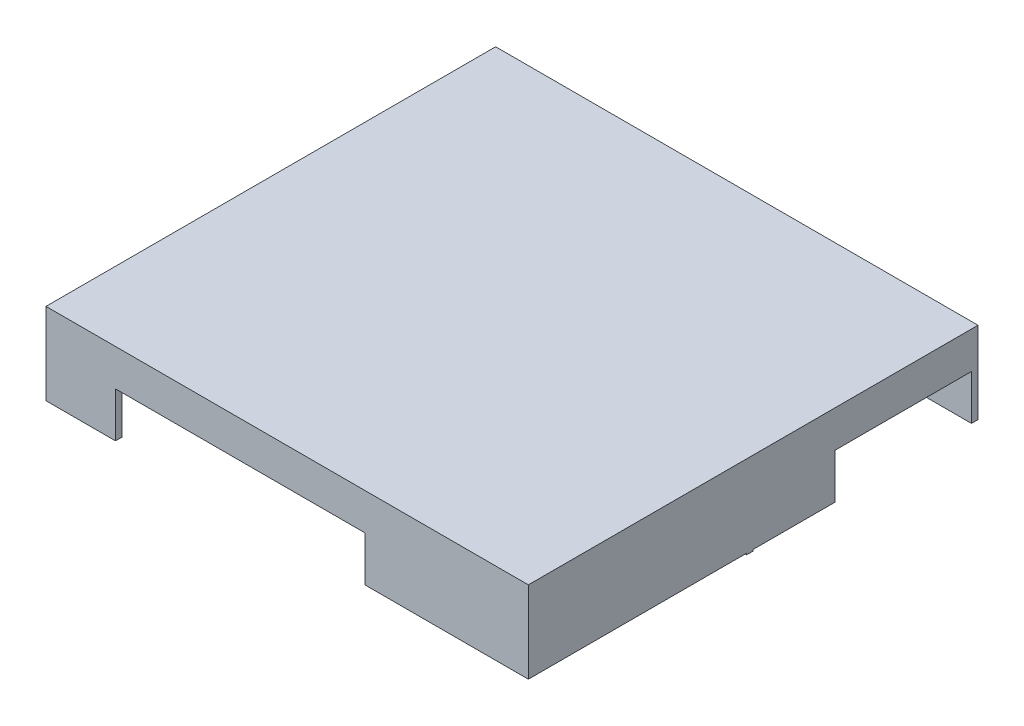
ISO-10303-21;
HEADER;
FILE_DESCRIPTION(('STEP AP214'),'2;1');
FILE_NAME('part.step','',(''),(''),'','','');
FILE_SCHEMA(('AUTOMOTIVE_DESIGN { 1 0 10303 214 1 1 1 1 }'));
ENDSEC;
DATA;
#1=APPLICATION_CONTEXT('core data for automotive mechanical design processes');
#2=APPLICATION_PROTOCOL_DEFINITION('international standard','automotive_design',2000,#1);
#3=PRODUCT_CONTEXT('',#1,'mechanical');
#4=PRODUCT('Part','Part','',(#3));
#5=PRODUCT_RELATED_PRODUCT_CATEGORY('part','',(#4));
#6=PRODUCT_DEFINITION_FORMATION('','',#4);
#7=PRODUCT_DEFINITION_CONTEXT('part definition',#1,'design');
#8=PRODUCT_DEFINITION('design','',#6,#7);
#9=PRODUCT_DEFINITION_SHAPE('','',#8);
#10=(LENGTH_UNIT() NAMED_UNIT(*) SI_UNIT(.MILLI.,.METRE.));
#11=(NAMED_UNIT(*) PLANE_ANGLE_UNIT() SI_UNIT($,.RADIAN.));
#12=(NAMED_UNIT(*) SI_UNIT($,.STERADIAN.) SOLID_ANGLE_UNIT());
#13=UNCERTAINTY_MEASURE_WITH_UNIT(LENGTH_MEASURE(1.E-05),#10,'distance_accuracy_value','');
#14=(GEOMETRIC_REPRESENTATION_CONTEXT(3) GLOBAL_UNCERTAINTY_ASSIGNED_CONTEXT((#13)) GLOBAL_UNIT_ASSIGNED_CONTEXT((#10,
#11,#12)) REPRESENTATION_CONTEXT('',''));
#15=CARTESIAN_POINT('',(0.,0.,0.));
#16=DIRECTION('',(0.,0.,1.));
#17=DIRECTION('',(1.,0.,0.));
#18=AXIS2_PLACEMENT_3D('',#15,#16,#17);
#19=CARTESIAN_POINT('',(0.,0.,0.));
#20=DIRECTION('',(0.,1.,0.));
#21=DIRECTION('',(0.,0.,1.));
#22=AXIS2_PLACEMENT_3D('',#19,#20,#21);
#23=PLANE('',#22);
#24=DIRECTION('',(1.,0.,0.));
#25=VECTOR('',#24,1.);
#26=CARTESIAN_POINT('',(-7.493,0.,6.985));
#27=LINE('',#26,#25);
#28=CARTESIAN_POINT('',(2.413,0.,6.985));
#29=VERTEX_POINT('',#28);
#30=CARTESIAN_POINT('',(7.493,0.,6.985));
#31=VERTEX_POINT('',#30);
#32=EDGE_CURVE('E283',#29,#31,#27,.T.);
#33=ORIENTED_EDGE('',*,*,#32,.F.);
#34=DIRECTION('',(0.,0.,1.));
#35=VECTOR('',#34,1.);
#36=CARTESIAN_POINT('',(2.413,0.,-6.986025));
#37=LINE('',#36,#35);
#38=CARTESIAN_POINT('',(2.413,0.,6.7818));
#39=VERTEX_POINT('',#38);
#40=EDGE_CURVE('E270',#39,#29,#37,.T.);
#41=ORIENTED_EDGE('',*,*,#40,.F.);
#42=DIRECTION('',(1.,0.,0.));
#43=VECTOR('',#42,1.);
#44=CARTESIAN_POINT('',(-7.493,0.,6.7818));
#45=LINE('',#44,#43);
#46=CARTESIAN_POINT('',(7.2898,0.,6.7818));
#47=VERTEX_POINT('',#46);
#48=EDGE_CURVE('E280',#39,#47,#45,.T.);
#49=ORIENTED_EDGE('',*,*,#48,.T.);
#50=DIRECTION('',(0.,0.,-1.));
#51=VECTOR('',#50,1.);
#52=CARTESIAN_POINT('',(7.2898,0.,-6.985));
#53=LINE('',#52,#51);
#54=CARTESIAN_POINT('',(7.2898,0.,0.203200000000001));
#55=VERTEX_POINT('',#54);
#56=EDGE_CURVE('E299',#47,#55,#53,.T.);
#57=ORIENTED_EDGE('',*,*,#56,.T.);
#58=DIRECTION('',(-1.,0.,0.));
#59=VECTOR('',#58,1.);
#60=CARTESIAN_POINT('',(7.2898,0.,0.203200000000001));
#61=LINE('',#60,#59);
#62=CARTESIAN_POINT('',(7.493,0.,0.203200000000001));
#63=VERTEX_POINT('',#62);
#64=EDGE_CURVE('E497',#63,#55,#61,.T.);
#65=ORIENTED_EDGE('',*,*,#64,.F.);
#66=DIRECTION('',(0.,0.,-1.));
#67=VECTOR('',#66,1.);
#68=CARTESIAN_POINT('',(7.493,0.,-6.985));
#69=LINE('',#68,#67);
#70=EDGE_CURVE('E538',#31,#63,#69,.T.);
#71=ORIENTED_EDGE('',*,*,#70,.F.);
#72=EDGE_LOOP('',(#33,#41,#49,#57,#65,#71));
#73=FACE_BOUND('',#72,.T.);
#74=ADVANCED_FACE('F38',(#73),#23,.F.);
#75=DIRECTION('',(-1.,0.,0.));
#76=VECTOR('',#75,1.);
#77=CARTESIAN_POINT('',(-7.493,0.,-6.7818));
#78=LINE('',#77,#76);
#79=CARTESIAN_POINT('',(-0.203199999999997,0.,-6.7818));
#80=VERTEX_POINT('',#79);
#81=CARTESIAN_POINT('',(-1.0414,0.,-6.7818));
#82=VERTEX_POINT('',#81);
#83=EDGE_CURVE('E569',#80,#82,#78,.T.);
#84=ORIENTED_EDGE('',*,*,#83,.T.);
#85=DIRECTION('',(0.,0.,-1.));
#86=VECTOR('',#85,1.);
#87=CARTESIAN_POINT('',(-1.0414,0.,6.986025));
#88=LINE('',#87,#86);
#89=CARTESIAN_POINT('',(-1.0414,0.,-6.985));
#90=VERTEX_POINT('',#89);
#91=EDGE_CURVE('E434',#82,#90,#88,.T.);
#92=ORIENTED_EDGE('',*,*,#91,.T.);
#93=DIRECTION('',(-1.,0.,0.));
#94=VECTOR('',#93,1.);
#95=CARTESIAN_POINT('',(-7.493,0.,-6.985));
#96=LINE('',#95,#94);
#97=CARTESIAN_POINT('',(-0.2032,0.,-6.985));
#98=VERTEX_POINT('',#97);
#99=EDGE_CURVE('E537',#98,#90,#96,.T.);
#100=ORIENTED_EDGE('',*,*,#99,.F.);
#101=DIRECTION('',(0.,0.,-1.));
#102=VECTOR('',#101,1.);
#103=CARTESIAN_POINT('',(-0.203199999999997,0.,-6.7818));
#104=LINE('',#103,#102);
#105=EDGE_CURVE('E470',#80,#98,#104,.T.);
#106=ORIENTED_EDGE('',*,*,#105,.F.);
#107=EDGE_LOOP('',(#84,#92,#100,#106));
#108=FACE_BOUND('',#107,.T.);
#109=ADVANCED_FACE('F568',(#108),#23,.F.);
#110=CARTESIAN_POINT('',(7.2898,0.,0.));
#111=VERTEX_POINT('',#110);
#112=CARTESIAN_POINT('',(7.2898,0.,-2.54));
#113=VERTEX_POINT('',#112);
#114=EDGE_CURVE('E294',#111,#113,#53,.T.);
#115=ORIENTED_EDGE('',*,*,#114,.T.);
#116=DIRECTION('',(1.,0.,0.));
#117=VECTOR('',#116,1.);
#118=CARTESIAN_POINT('',(-7.49405,0.,-2.54));
#119=LINE('',#118,#117);
#120=CARTESIAN_POINT('',(7.493,0.,-2.54));
#121=VERTEX_POINT('',#120);
#122=EDGE_CURVE('E456',#113,#121,#119,.T.);
#123=ORIENTED_EDGE('',*,*,#122,.T.);
#124=CARTESIAN_POINT('',(7.493,0.,0.));
#125=VERTEX_POINT('',#124);
#126=EDGE_CURVE('E541',#125,#121,#69,.T.);
#127=ORIENTED_EDGE('',*,*,#126,.F.);
#128=DIRECTION('',(1.,0.,0.));
#129=VECTOR('',#128,1.);
#130=CARTESIAN_POINT('',(7.2898,0.,0.));
#131=LINE('',#130,#129);
#132=EDGE_CURVE('E492',#111,#125,#131,.T.);
#133=ORIENTED_EDGE('',*,*,#132,.F.);
#134=EDGE_LOOP('',(#115,#123,#127,#133));
#135=FACE_BOUND('',#134,.T.);
#136=ADVANCED_FACE('F597',(#135),#23,.F.);
#137=CARTESIAN_POINT('',(7.493,0.,-6.7818));
#138=VERTEX_POINT('',#137);
#139=CARTESIAN_POINT('',(7.493,0.,-6.985));
#140=VERTEX_POINT('',#139);
#141=EDGE_CURVE('E542',#138,#140,#69,.T.);
#142=ORIENTED_EDGE('',*,*,#141,.F.);
#143=CARTESIAN_POINT('',(0.,0.,-6.7818));
#144=VERTEX_POINT('',#143);
#145=EDGE_CURVE('E683',#138,#144,#78,.T.);
#146=ORIENTED_EDGE('',*,*,#145,.T.);
#147=DIRECTION('',(0.,0.,1.));
#148=VECTOR('',#147,1.);
#149=CARTESIAN_POINT('',(0.,0.,-6.7818));
#150=LINE('',#149,#148);
#151=CARTESIAN_POINT('',(0.,0.,-6.985));
#152=VERTEX_POINT('',#151);
#153=EDGE_CURVE('E465',#152,#144,#150,.T.);
#154=ORIENTED_EDGE('',*,*,#153,.F.);
#155=EDGE_CURVE('E305',#140,#152,#96,.T.);
#156=ORIENTED_EDGE('',*,*,#155,.F.);
#157=EDGE_LOOP('',(#142,#146,#154,#156));
#158=FACE_BOUND('',#157,.T.);
#159=ADVANCED_FACE('F593',(#158),#23,.F.);
#160=CARTESIAN_POINT('',(-7.2898,0.,-6.985));
#161=VERTEX_POINT('',#160);
#162=CARTESIAN_POINT('',(-7.493,0.,-6.985));
#163=VERTEX_POINT('',#162);
#164=EDGE_CURVE('E532',#161,#163,#96,.T.);
#165=ORIENTED_EDGE('',*,*,#164,.F.);
#166=DIRECTION('',(0.,0.,1.));
#167=VECTOR('',#166,1.);
#168=CARTESIAN_POINT('',(-7.2898,0.,-6.985));
#169=LINE('',#168,#167);
#170=CARTESIAN_POINT('',(-7.2898,0.,0.));
#171=VERTEX_POINT('',#170);
#172=EDGE_CURVE('E291',#161,#171,#169,.T.);
#173=ORIENTED_EDGE('',*,*,#172,.T.);
#174=DIRECTION('',(1.,0.,0.));
#175=VECTOR('',#174,1.);
#176=CARTESIAN_POINT('',(-7.2898,0.,0.));
#177=LINE('',#176,#175);
#178=CARTESIAN_POINT('',(-7.493,0.,0.));
#179=VERTEX_POINT('',#178);
#180=EDGE_CURVE('E325',#179,#171,#177,.T.);
#181=ORIENTED_EDGE('',*,*,#180,.F.);
#182=DIRECTION('',(0.,0.,1.));
#183=VECTOR('',#182,1.);
#184=CARTESIAN_POINT('',(-7.493,0.,-6.985));
#185=LINE('',#184,#183);
#186=EDGE_CURVE('E317',#163,#179,#185,.T.);
#187=ORIENTED_EDGE('',*,*,#186,.F.);
#188=EDGE_LOOP('',(#165,#173,#181,#187));
#189=FACE_BOUND('',#188,.T.);
#190=ADVANCED_FACE('F536',(#189),#23,.F.);
#191=CARTESIAN_POINT('',(-7.2898,0.,6.7818));
#192=VERTEX_POINT('',#191);
#193=CARTESIAN_POINT('',(-5.334,0.,6.7818));
#194=VERTEX_POINT('',#193);
#195=EDGE_CURVE('E290',#192,#194,#45,.T.);
#196=ORIENTED_EDGE('',*,*,#195,.T.);
#197=DIRECTION('',(0.,0.,1.));
#198=VECTOR('',#197,1.);
#199=CARTESIAN_POINT('',(-5.334,0.,-6.986025));
#200=LINE('',#199,#198);
#201=CARTESIAN_POINT('',(-5.334,0.,6.985));
#202=VERTEX_POINT('',#201);
#203=EDGE_CURVE('E56',#194,#202,#200,.T.);
#204=ORIENTED_EDGE('',*,*,#203,.T.);
#205=CARTESIAN_POINT('',(-7.493,0.,6.985));
#206=VERTEX_POINT('',#205);
#207=EDGE_CURVE('E313',#206,#202,#27,.T.);
#208=ORIENTED_EDGE('',*,*,#207,.F.);
#209=CARTESIAN_POINT('',(-7.493,0.,6.785));
#210=VERTEX_POINT('',#209);
#211=EDGE_CURVE('E42',#210,#206,#185,.T.);
#212=ORIENTED_EDGE('',*,*,#211,.F.);
#213=DIRECTION('',(-1.,0.,0.));
#214=VECTOR('',#213,1.);
#215=CARTESIAN_POINT('',(-0.511055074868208,0.,6.785));
#216=LINE('',#215,#214);
#217=CARTESIAN_POINT('',(-7.2898,0.,6.785));
#218=VERTEX_POINT('',#217);
#219=EDGE_CURVE('E377',#218,#210,#216,.T.);
#220=ORIENTED_EDGE('',*,*,#219,.F.);
#221=DIRECTION('',(0.,0.,1.));
#222=VECTOR('',#221,1.);
#223=CARTESIAN_POINT('',(-7.2898,0.,0.1524));
#224=LINE('',#223,#222);
#225=EDGE_CURVE('E378',#192,#218,#224,.T.);
#226=ORIENTED_EDGE('',*,*,#225,.F.);
#227=EDGE_LOOP('',(#196,#204,#208,#212,#220,#226));
#228=FACE_BOUND('',#227,.T.);
#229=ADVANCED_FACE('F601',(#228),#23,.F.);
#230=CARTESIAN_POINT('',(-7.493,2.54,-6.985));
#231=DIRECTION('',(1.,0.,0.));
#232=DIRECTION('',(0.,0.,-1.));
#233=AXIS2_PLACEMENT_3D('',#230,#231,#232);
#234=PLANE('',#233);
#235=DIRECTION('',(0.,1.,0.));
#236=VECTOR('',#235,1.);
#237=CARTESIAN_POINT('',(-7.493,-0.045,0.203200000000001));
#238=LINE('',#237,#236);
#239=CARTESIAN_POINT('',(-7.493,-0.045,0.203200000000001));
#240=VERTEX_POINT('',#239);
#241=CARTESIAN_POINT('',(-7.493,0.,0.203200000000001));
#242=VERTEX_POINT('',#241);
#243=EDGE_CURVE('E327',#240,#242,#238,.T.);
#244=ORIENTED_EDGE('',*,*,#243,.T.);
#245=DIRECTION('',(0.,0.,1.));
#246=VECTOR('',#245,1.);
#247=CARTESIAN_POINT('',(-7.493,0.,0.1524));
#248=LINE('',#247,#246);
#249=CARTESIAN_POINT('',(-7.493,0.,0.1524));
#250=VERTEX_POINT('',#249);
#251=EDGE_CURVE('E425',#250,#242,#248,.T.);
#252=ORIENTED_EDGE('',*,*,#251,.F.);
#253=DIRECTION('',(0.,-1.,0.));
#254=VECTOR('',#253,1.);
#255=CARTESIAN_POINT('',(-7.493,0.,0.1524));
#256=LINE('',#255,#254);
#257=CARTESIAN_POINT('',(-7.493,1.4,0.1524));
#258=VERTEX_POINT('',#257);
#259=EDGE_CURVE('E391',#258,#250,#256,.T.);
#260=ORIENTED_EDGE('',*,*,#259,.F.);
#261=DIRECTION('',(0.,0.,-1.));
#262=VECTOR('',#261,1.);
#263=CARTESIAN_POINT('',(-7.493,1.4,0.1524));
#264=LINE('',#263,#262);
#265=CARTESIAN_POINT('',(-7.493,1.4,6.785));
#266=VERTEX_POINT('',#265);
#267=EDGE_CURVE('E382',#266,#258,#264,.T.);
#268=ORIENTED_EDGE('',*,*,#267,.F.);
#269=DIRECTION('',(0.,1.,0.));
#270=VECTOR('',#269,1.);
#271=CARTESIAN_POINT('',(-7.493,0.,6.785));
#272=LINE('',#271,#270);
#273=EDGE_CURVE('E620',#210,#266,#272,.T.);
#274=ORIENTED_EDGE('',*,*,#273,.F.);
#275=ORIENTED_EDGE('',*,*,#211,.T.);
#276=DIRECTION('',(0.,-1.,0.));
#277=VECTOR('',#276,1.);
#278=CARTESIAN_POINT('',(-7.493,2.54,6.985));
#279=LINE('',#278,#277);
#280=CARTESIAN_POINT('',(-7.493,2.54,6.985));
#281=VERTEX_POINT('',#280);
#282=EDGE_CURVE('E11',#281,#206,#279,.T.);
#283=ORIENTED_EDGE('',*,*,#282,.F.);
#284=DIRECTION('',(0.,0.,1.));
#285=VECTOR('',#284,1.);
#286=CARTESIAN_POINT('',(-7.493,2.54,-6.985));
#287=LINE('',#286,#285);
#288=CARTESIAN_POINT('',(-7.493,2.54,-6.985));
#289=VERTEX_POINT('',#288);
#290=EDGE_CURVE('E301',#289,#281,#287,.T.);
#291=ORIENTED_EDGE('',*,*,#290,.F.);
#292=DIRECTION('',(0.,-1.,0.));
#293=VECTOR('',#292,1.);
#294=CARTESIAN_POINT('',(-7.493,2.54,-6.985));
#295=LINE('',#294,#293);
#296=EDGE_CURVE('E310',#289,#163,#295,.T.);
#297=ORIENTED_EDGE('',*,*,#296,.T.);
#298=ORIENTED_EDGE('',*,*,#186,.T.);
#299=DIRECTION('',(0.,1.,0.));
#300=VECTOR('',#299,1.);
#301=CARTESIAN_POINT('',(-7.493,-0.045,0.));
#302=LINE('',#301,#300);
#303=CARTESIAN_POINT('',(-7.493,-0.045,0.));
#304=VERTEX_POINT('',#303);
#305=EDGE_CURVE('E348',#304,#179,#302,.T.);
#306=ORIENTED_EDGE('',*,*,#305,.F.);
#307=DIRECTION('',(0.,0.,-1.));
#308=VECTOR('',#307,1.);
#309=CARTESIAN_POINT('',(-7.493,-0.045,0.));
#310=LINE('',#309,#308);
#311=EDGE_CURVE('E519',#240,#304,#310,.T.);
#312=ORIENTED_EDGE('',*,*,#311,.F.);
#313=EDGE_LOOP('',(#244,#252,#260,#268,#274,#275,#283,#291,#297,#298,#306,#312));
#314=FACE_BOUND('',#313,.T.);
#315=ADVANCED_FACE('F40',(#314),#234,.F.);
#316=CARTESIAN_POINT('',(-7.493,2.54,6.985));
#317=DIRECTION('',(0.,0.,-1.));
#318=DIRECTION('',(-1.,0.,0.));
#319=AXIS2_PLACEMENT_3D('',#316,#317,#318);
#320=PLANE('',#319);
#321=DIRECTION('',(-1.,0.,0.));
#322=VECTOR('',#321,1.);
#323=CARTESIAN_POINT('',(-5.334,1.4,6.985));
#324=LINE('',#323,#322);
#325=CARTESIAN_POINT('',(2.413,1.4,6.985));
#326=VERTEX_POINT('',#325);
#327=CARTESIAN_POINT('',(-5.334,1.4,6.985));
#328=VERTEX_POINT('',#327);
#329=EDGE_CURVE('E637',#326,#328,#324,.T.);
#330=ORIENTED_EDGE('',*,*,#329,.F.);
#331=DIRECTION('',(0.,1.,0.));
#332=VECTOR('',#331,1.);
#333=CARTESIAN_POINT('',(2.413,0.,6.985));
#334=LINE('',#333,#332);
#335=EDGE_CURVE('E635',#29,#326,#334,.T.);
#336=ORIENTED_EDGE('',*,*,#335,.F.);
#337=ORIENTED_EDGE('',*,*,#32,.T.);
#338=DIRECTION('',(0.,-1.,0.));
#339=VECTOR('',#338,1.);
#340=CARTESIAN_POINT('',(7.493,2.54,6.985));
#341=LINE('',#340,#339);
#342=CARTESIAN_POINT('',(7.493,2.54,6.985));
#343=VERTEX_POINT('',#342);
#344=EDGE_CURVE('E48',#343,#31,#341,.T.);
#345=ORIENTED_EDGE('',*,*,#344,.F.);
#346=DIRECTION('',(1.,0.,0.));
#347=VECTOR('',#346,1.);
#348=CARTESIAN_POINT('',(-7.493,2.54,6.985));
#349=LINE('',#348,#347);
#350=EDGE_CURVE('E304',#281,#343,#349,.T.);
#351=ORIENTED_EDGE('',*,*,#350,.F.);
#352=ORIENTED_EDGE('',*,*,#282,.T.);
#353=ORIENTED_EDGE('',*,*,#207,.T.);
#354=DIRECTION('',(0.,-1.,0.));
#355=VECTOR('',#354,1.);
#356=CARTESIAN_POINT('',(-5.334,0.,6.985));
#357=LINE('',#356,#355);
#358=EDGE_CURVE('E284',#328,#202,#357,.T.);
#359=ORIENTED_EDGE('',*,*,#358,.F.);
#360=EDGE_LOOP('',(#330,#336,#337,#345,#351,#352,#353,#359));
#361=FACE_BOUND('',#360,.T.);
#362=ADVANCED_FACE('F612',(#361),#320,.F.);
#363=CARTESIAN_POINT('',(7.493,2.54,-6.985));
#364=DIRECTION('',(-1.,0.,0.));
#365=DIRECTION('',(0.,0.,1.));
#366=AXIS2_PLACEMENT_3D('',#363,#364,#365);
#367=PLANE('',#366);
#368=ORIENTED_EDGE('',*,*,#126,.T.);
#369=DIRECTION('',(0.,-1.,0.));
#370=VECTOR('',#369,1.);
#371=CARTESIAN_POINT('',(7.493,0.,-2.54));
#372=LINE('',#371,#370);
#373=CARTESIAN_POINT('',(7.493,1.397,-2.54));
#374=VERTEX_POINT('',#373);
#375=EDGE_CURVE('E453',#374,#121,#372,.T.);
#376=ORIENTED_EDGE('',*,*,#375,.F.);
#377=DIRECTION('',(0.,0.,1.));
#378=VECTOR('',#377,1.);
#379=CARTESIAN_POINT('',(7.493,1.397,-6.7818));
#380=LINE('',#379,#378);
#381=CARTESIAN_POINT('',(7.493,1.397,-6.7818));
#382=VERTEX_POINT('',#381);
#383=EDGE_CURVE('E450',#382,#374,#380,.T.);
#384=ORIENTED_EDGE('',*,*,#383,.F.);
#385=DIRECTION('',(0.,1.,0.));
#386=VECTOR('',#385,1.);
#387=CARTESIAN_POINT('',(7.493,0.,-6.7818));
#388=LINE('',#387,#386);
#389=EDGE_CURVE('E447',#138,#382,#388,.T.);
#390=ORIENTED_EDGE('',*,*,#389,.F.);
#391=ORIENTED_EDGE('',*,*,#141,.T.);
#392=DIRECTION('',(0.,-1.,0.));
#393=VECTOR('',#392,1.);
#394=CARTESIAN_POINT('',(7.493,2.54,-6.985));
#395=LINE('',#394,#393);
#396=CARTESIAN_POINT('',(7.493,2.54,-6.985));
#397=VERTEX_POINT('',#396);
#398=EDGE_CURVE('E552',#397,#140,#395,.T.);
#399=ORIENTED_EDGE('',*,*,#398,.F.);
#400=DIRECTION('',(0.,0.,-1.));
#401=VECTOR('',#400,1.);
#402=CARTESIAN_POINT('',(7.493,2.54,-6.985));
#403=LINE('',#402,#401);
#404=EDGE_CURVE('E307',#343,#397,#403,.T.);
#405=ORIENTED_EDGE('',*,*,#404,.F.);
#406=ORIENTED_EDGE('',*,*,#344,.T.);
#407=ORIENTED_EDGE('',*,*,#70,.T.);
#408=DIRECTION('',(0.,1.,0.));
#409=VECTOR('',#408,1.);
#410=CARTESIAN_POINT('',(7.493,-0.045,0.203200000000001));
#411=LINE('',#410,#409);
#412=CARTESIAN_POINT('',(7.493,-0.045,0.203200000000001));
#413=VERTEX_POINT('',#412);
#414=EDGE_CURVE('E510',#413,#63,#411,.T.);
#415=ORIENTED_EDGE('',*,*,#414,.F.);
#416=DIRECTION('',(0.,0.,1.));
#417=VECTOR('',#416,1.);
#418=CARTESIAN_POINT('',(7.493,-0.045,0.));
#419=LINE('',#418,#417);
#420=CARTESIAN_POINT('',(7.493,-0.045,0.));
#421=VERTEX_POINT('',#420);
#422=EDGE_CURVE('E499',#421,#413,#419,.T.);
#423=ORIENTED_EDGE('',*,*,#422,.F.);
#424=DIRECTION('',(0.,1.,0.));
#425=VECTOR('',#424,1.);
#426=CARTESIAN_POINT('',(7.493,-0.045,0.));
#427=LINE('',#426,#425);
#428=EDGE_CURVE('E513',#421,#125,#427,.T.);
#429=ORIENTED_EDGE('',*,*,#428,.T.);
#430=EDGE_LOOP('',(#368,#376,#384,#390,#391,#399,#405,#406,#407,#415,#423,#429));
#431=FACE_BOUND('',#430,.T.);
#432=ADVANCED_FACE('F655',(#431),#367,.F.);
#433=CARTESIAN_POINT('',(-7.493,2.54,-6.985));
#434=DIRECTION('',(0.,0.,1.));
#435=DIRECTION('',(1.,0.,0.));
#436=AXIS2_PLACEMENT_3D('',#433,#434,#435);
#437=PLANE('',#436);
#438=ORIENTED_EDGE('',*,*,#99,.T.);
#439=DIRECTION('',(0.,-1.,0.));
#440=VECTOR('',#439,1.);
#441=CARTESIAN_POINT('',(-1.0414,0.,-6.985));
#442=LINE('',#441,#440);
#443=CARTESIAN_POINT('',(-1.0414,1.4,-6.985));
#444=VERTEX_POINT('',#443);
#445=EDGE_CURVE('E432',#444,#90,#442,.T.);
#446=ORIENTED_EDGE('',*,*,#445,.F.);
#447=DIRECTION('',(1.,0.,0.));
#448=VECTOR('',#447,1.);
#449=CARTESIAN_POINT('',(-7.2898,1.4,-6.985));
#450=LINE('',#449,#448);
#451=CARTESIAN_POINT('',(-7.2898,1.4,-6.985));
#452=VERTEX_POINT('',#451);
#453=EDGE_CURVE('E428',#452,#444,#450,.T.);
#454=ORIENTED_EDGE('',*,*,#453,.F.);
#455=DIRECTION('',(0.,1.,0.));
#456=VECTOR('',#455,1.);
#457=CARTESIAN_POINT('',(-7.2898,0.,-6.985));
#458=LINE('',#457,#456);
#459=EDGE_CURVE('E423',#161,#452,#458,.T.);
#460=ORIENTED_EDGE('',*,*,#459,.F.);
#461=ORIENTED_EDGE('',*,*,#164,.T.);
#462=ORIENTED_EDGE('',*,*,#296,.F.);
#463=DIRECTION('',(-1.,0.,0.));
#464=VECTOR('',#463,1.);
#465=CARTESIAN_POINT('',(-7.493,2.54,-6.985));
#466=LINE('',#465,#464);
#467=EDGE_CURVE('E309',#397,#289,#466,.T.);
#468=ORIENTED_EDGE('',*,*,#467,.F.);
#469=ORIENTED_EDGE('',*,*,#398,.T.);
#470=ORIENTED_EDGE('',*,*,#155,.T.);
#471=DIRECTION('',(0.,1.,0.));
#472=VECTOR('',#471,1.);
#473=CARTESIAN_POINT('',(0.,-0.045,-6.985));
#474=LINE('',#473,#472);
#475=CARTESIAN_POINT('',(0.,-0.045,-6.985));
#476=VERTEX_POINT('',#475);
#477=EDGE_CURVE('E476',#476,#152,#474,.T.);
#478=ORIENTED_EDGE('',*,*,#477,.F.);
#479=DIRECTION('',(1.,0.,0.));
#480=VECTOR('',#479,1.);
#481=CARTESIAN_POINT('',(0.,-0.045,-6.985));
#482=LINE('',#481,#480);
#483=CARTESIAN_POINT('',(-0.2032,-0.045,-6.985));
#484=VERTEX_POINT('',#483);
#485=EDGE_CURVE('E474',#484,#476,#482,.T.);
#486=ORIENTED_EDGE('',*,*,#485,.F.);
#487=DIRECTION('',(0.,1.,0.));
#488=VECTOR('',#487,1.);
#489=CARTESIAN_POINT('',(-0.2032,-0.045,-6.985));
#490=LINE('',#489,#488);
#491=EDGE_CURVE('E483',#484,#98,#490,.T.);
#492=ORIENTED_EDGE('',*,*,#491,.T.);
#493=EDGE_LOOP('',(#438,#446,#454,#460,#461,#462,#468,#469,#470,#478,#486,#492));
#494=FACE_BOUND('',#493,.T.);
#495=ADVANCED_FACE('F530',(#494),#437,.F.);
#496=CARTESIAN_POINT('',(0.,2.54,0.));
#497=DIRECTION('',(0.,1.,0.));
#498=DIRECTION('',(0.,0.,1.));
#499=AXIS2_PLACEMENT_3D('',#496,#497,#498);
#500=PLANE('',#499);
#501=ORIENTED_EDGE('',*,*,#290,.T.);
#502=ORIENTED_EDGE('',*,*,#350,.T.);
#503=ORIENTED_EDGE('',*,*,#404,.T.);
#504=ORIENTED_EDGE('',*,*,#467,.T.);
#505=EDGE_LOOP('',(#501,#502,#503,#504));
#506=FACE_BOUND('',#505,.T.);
#507=ADVANCED_FACE('F697',(#506),#500,.T.);
#508=CARTESIAN_POINT('',(-7.2898,2.54,-6.985));
#509=DIRECTION('',(1.,0.,0.));
#510=DIRECTION('',(0.,0.,-1.));
#511=AXIS2_PLACEMENT_3D('',#508,#509,#510);
#512=PLANE('',#511);
#513=CARTESIAN_POINT('',(-7.2898,0.,0.1524));
#514=VERTEX_POINT('',#513);
#515=CARTESIAN_POINT('',(-7.2898,0.,0.203200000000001));
#516=VERTEX_POINT('',#515);
#517=EDGE_CURVE('E372',#514,#516,#224,.T.);
#518=ORIENTED_EDGE('',*,*,#517,.T.);
#519=DIRECTION('',(0.,1.,0.));
#520=VECTOR('',#519,1.);
#521=CARTESIAN_POINT('',(-7.2898,-0.045,0.203200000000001));
#522=LINE('',#521,#520);
#523=CARTESIAN_POINT('',(-7.2898,-0.045,0.203200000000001));
#524=VERTEX_POINT('',#523);
#525=EDGE_CURVE('E295',#524,#516,#522,.T.);
#526=ORIENTED_EDGE('',*,*,#525,.F.);
#527=DIRECTION('',(0.,0.,1.));
#528=VECTOR('',#527,1.);
#529=CARTESIAN_POINT('',(-7.2898,-0.045,0.));
#530=LINE('',#529,#528);
#531=CARTESIAN_POINT('',(-7.2898,-0.045,0.));
#532=VERTEX_POINT('',#531);
#533=EDGE_CURVE('E342',#532,#524,#530,.T.);
#534=ORIENTED_EDGE('',*,*,#533,.F.);
#535=DIRECTION('',(0.,1.,0.));
#536=VECTOR('',#535,1.);
#537=CARTESIAN_POINT('',(-7.2898,-0.045,0.));
#538=LINE('',#537,#536);
#539=EDGE_CURVE('E345',#532,#171,#538,.T.);
#540=ORIENTED_EDGE('',*,*,#539,.T.);
#541=ORIENTED_EDGE('',*,*,#172,.F.);
#542=ORIENTED_EDGE('',*,*,#459,.T.);
#543=DIRECTION('',(0.,0.,-1.));
#544=VECTOR('',#543,1.);
#545=CARTESIAN_POINT('',(-7.2898,1.4,6.986025));
#546=LINE('',#545,#544);
#547=CARTESIAN_POINT('',(-7.2898,1.4,-6.7818));
#548=VERTEX_POINT('',#547);
#549=EDGE_CURVE('E64',#548,#452,#546,.T.);
#550=ORIENTED_EDGE('',*,*,#549,.F.);
#551=DIRECTION('',(0.,-1.,0.));
#552=VECTOR('',#551,1.);
#553=CARTESIAN_POINT('',(-7.2898,2.54,-6.7818));
#554=LINE('',#553,#552);
#555=CARTESIAN_POINT('',(-7.2898,2.3368,-6.7818));
#556=VERTEX_POINT('',#555);
#557=EDGE_CURVE('E576',#556,#548,#554,.T.);
#558=ORIENTED_EDGE('',*,*,#557,.F.);
#559=DIRECTION('',(0.,0.,1.));
#560=VECTOR('',#559,1.);
#561=CARTESIAN_POINT('',(-7.2898,2.3368,-6.985));
#562=LINE('',#561,#560);
#563=CARTESIAN_POINT('',(-7.2898,2.3368,6.7818));
#564=VERTEX_POINT('',#563);
#565=EDGE_CURVE('E684',#556,#564,#562,.T.);
#566=ORIENTED_EDGE('',*,*,#565,.T.);
#567=DIRECTION('',(0.,-1.,0.));
#568=VECTOR('',#567,1.);
#569=CARTESIAN_POINT('',(-7.2898,2.54,6.7818));
#570=LINE('',#569,#568);
#571=CARTESIAN_POINT('',(-7.2898,1.4,6.7818));
#572=VERTEX_POINT('',#571);
#573=EDGE_CURVE('E336',#564,#572,#570,.T.);
#574=ORIENTED_EDGE('',*,*,#573,.T.);
#575=DIRECTION('',(0.,0.,-1.));
#576=VECTOR('',#575,1.);
#577=CARTESIAN_POINT('',(-7.2898,1.4,0.1524));
#578=LINE('',#577,#576);
#579=CARTESIAN_POINT('',(-7.2898,1.4,0.1524));
#580=VERTEX_POINT('',#579);
#581=EDGE_CURVE('E399',#572,#580,#578,.T.);
#582=ORIENTED_EDGE('',*,*,#581,.T.);
#583=DIRECTION('',(0.,-1.,0.));
#584=VECTOR('',#583,1.);
#585=CARTESIAN_POINT('',(-7.2898,0.,0.1524));
#586=LINE('',#585,#584);
#587=EDGE_CURVE('E374',#580,#514,#586,.T.);
#588=ORIENTED_EDGE('',*,*,#587,.T.);
#589=EDGE_LOOP('',(#518,#526,#534,#540,#541,#542,#550,#558,#566,#574,#582,#588));
#590=FACE_BOUND('',#589,.T.);
#591=ADVANCED_FACE('F370',(#590),#512,.T.);
#592=CARTESIAN_POINT('',(-7.493,2.54,6.7818));
#593=DIRECTION('',(0.,0.,-1.));
#594=DIRECTION('',(-1.,0.,0.));
#595=AXIS2_PLACEMENT_3D('',#592,#593,#594);
#596=PLANE('',#595);
#597=DIRECTION('',(0.,1.,0.));
#598=VECTOR('',#597,1.);
#599=CARTESIAN_POINT('',(2.413,0.,6.7818));
#600=LINE('',#599,#598);
#601=CARTESIAN_POINT('',(2.413,1.4,6.7818));
#602=VERTEX_POINT('',#601);
#603=EDGE_CURVE('E266',#39,#602,#600,.T.);
#604=ORIENTED_EDGE('',*,*,#603,.T.);
#605=DIRECTION('',(-1.,0.,0.));
#606=VECTOR('',#605,1.);
#607=CARTESIAN_POINT('',(-5.334,1.4,6.7818));
#608=LINE('',#607,#606);
#609=CARTESIAN_POINT('',(-5.334,1.4,6.7818));
#610=VERTEX_POINT('',#609);
#611=EDGE_CURVE('E630',#602,#610,#608,.T.);
#612=ORIENTED_EDGE('',*,*,#611,.T.);
#613=DIRECTION('',(0.,-1.,0.));
#614=VECTOR('',#613,1.);
#615=CARTESIAN_POINT('',(-5.334,0.,6.7818));
#616=LINE('',#615,#614);
#617=EDGE_CURVE('E628',#610,#194,#616,.T.);
#618=ORIENTED_EDGE('',*,*,#617,.T.);
#619=ORIENTED_EDGE('',*,*,#195,.F.);
#620=DIRECTION('',(0.,-1.,0.));
#621=VECTOR('',#620,1.);
#622=CARTESIAN_POINT('',(-7.2898,2.54,6.7818));
#623=LINE('',#622,#621);
#624=EDGE_CURVE('E416',#572,#192,#623,.T.);
#625=ORIENTED_EDGE('',*,*,#624,.F.);
#626=ORIENTED_EDGE('',*,*,#573,.F.);
#627=DIRECTION('',(1.,0.,0.));
#628=VECTOR('',#627,1.);
#629=CARTESIAN_POINT('',(-7.493,2.3368,6.7818));
#630=LINE('',#629,#628);
#631=CARTESIAN_POINT('',(7.2898,2.3368,6.7818));
#632=VERTEX_POINT('',#631);
#633=EDGE_CURVE('E685',#564,#632,#630,.T.);
#634=ORIENTED_EDGE('',*,*,#633,.T.);
#635=DIRECTION('',(0.,-1.,0.));
#636=VECTOR('',#635,1.);
#637=CARTESIAN_POINT('',(7.2898,2.54,6.7818));
#638=LINE('',#637,#636);
#639=EDGE_CURVE('E289',#632,#47,#638,.T.);
#640=ORIENTED_EDGE('',*,*,#639,.T.);
#641=ORIENTED_EDGE('',*,*,#48,.F.);
#642=EDGE_LOOP('',(#604,#612,#618,#619,#625,#626,#634,#640,#641));
#643=FACE_BOUND('',#642,.T.);
#644=ADVANCED_FACE('F287',(#643),#596,.T.);
#645=CARTESIAN_POINT('',(7.2898,2.54,-6.985));
#646=DIRECTION('',(-1.,0.,0.));
#647=DIRECTION('',(0.,0.,1.));
#648=AXIS2_PLACEMENT_3D('',#645,#646,#647);
#649=PLANE('',#648);
#650=DIRECTION('',(0.,0.,1.));
#651=VECTOR('',#650,1.);
#652=CARTESIAN_POINT('',(7.2898,1.397,-6.7818));
#653=LINE('',#652,#651);
#654=CARTESIAN_POINT('',(7.2898,1.397,-6.7818));
#655=VERTEX_POINT('',#654);
#656=CARTESIAN_POINT('',(7.2898,1.397,-2.54));
#657=VERTEX_POINT('',#656);
#658=EDGE_CURVE('E459',#655,#657,#653,.T.);
#659=ORIENTED_EDGE('',*,*,#658,.T.);
#660=DIRECTION('',(0.,-1.,0.));
#661=VECTOR('',#660,1.);
#662=CARTESIAN_POINT('',(7.2898,0.,-2.54));
#663=LINE('',#662,#661);
#664=EDGE_CURVE('E444',#657,#113,#663,.T.);
#665=ORIENTED_EDGE('',*,*,#664,.T.);
#666=ORIENTED_EDGE('',*,*,#114,.F.);
#667=DIRECTION('',(0.,1.,0.));
#668=VECTOR('',#667,1.);
#669=CARTESIAN_POINT('',(7.2898,-0.045,0.));
#670=LINE('',#669,#668);
#671=CARTESIAN_POINT('',(7.2898,-0.045,0.));
#672=VERTEX_POINT('',#671);
#673=EDGE_CURVE('E326',#672,#111,#670,.T.);
#674=ORIENTED_EDGE('',*,*,#673,.F.);
#675=DIRECTION('',(0.,0.,-1.));
#676=VECTOR('',#675,1.);
#677=CARTESIAN_POINT('',(7.2898,-0.045,0.));
#678=LINE('',#677,#676);
#679=CARTESIAN_POINT('',(7.2898,-0.045,0.203200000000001));
#680=VERTEX_POINT('',#679);
#681=EDGE_CURVE('E493',#680,#672,#678,.T.);
#682=ORIENTED_EDGE('',*,*,#681,.F.);
#683=DIRECTION('',(0.,1.,0.));
#684=VECTOR('',#683,1.);
#685=CARTESIAN_POINT('',(7.2898,-0.045,0.203200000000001));
#686=LINE('',#685,#684);
#687=EDGE_CURVE('E503',#680,#55,#686,.T.);
#688=ORIENTED_EDGE('',*,*,#687,.T.);
#689=ORIENTED_EDGE('',*,*,#56,.F.);
#690=ORIENTED_EDGE('',*,*,#639,.F.);
#691=DIRECTION('',(0.,0.,-1.));
#692=VECTOR('',#691,1.);
#693=CARTESIAN_POINT('',(7.2898,2.3368,-6.985));
#694=LINE('',#693,#692);
#695=CARTESIAN_POINT('',(7.2898,2.3368,-6.7818));
#696=VERTEX_POINT('',#695);
#697=EDGE_CURVE('E690',#632,#696,#694,.T.);
#698=ORIENTED_EDGE('',*,*,#697,.T.);
#699=DIRECTION('',(0.,-1.,0.));
#700=VECTOR('',#699,1.);
#701=CARTESIAN_POINT('',(7.2898,2.54,-6.7818));
#702=LINE('',#701,#700);
#703=EDGE_CURVE('E679',#696,#655,#702,.T.);
#704=ORIENTED_EDGE('',*,*,#703,.T.);
#705=EDGE_LOOP('',(#659,#665,#666,#674,#682,#688,#689,#690,#698,#704));
#706=FACE_BOUND('',#705,.T.);
#707=ADVANCED_FACE('F664',(#706),#649,.T.);
#708=CARTESIAN_POINT('',(-7.493,2.54,-6.7818));
#709=DIRECTION('',(0.,0.,1.));
#710=DIRECTION('',(1.,0.,0.));
#711=AXIS2_PLACEMENT_3D('',#708,#709,#710);
#712=PLANE('',#711);
#713=DIRECTION('',(1.,0.,0.));
#714=VECTOR('',#713,1.);
#715=CARTESIAN_POINT('',(-7.2898,1.4,-6.7818));
#716=LINE('',#715,#714);
#717=CARTESIAN_POINT('',(-1.0414,1.4,-6.7818));
#718=VERTEX_POINT('',#717);
#719=EDGE_CURVE('E437',#548,#718,#716,.T.);
#720=ORIENTED_EDGE('',*,*,#719,.T.);
#721=DIRECTION('',(0.,-1.,0.));
#722=VECTOR('',#721,1.);
#723=CARTESIAN_POINT('',(-1.0414,0.,-6.7818));
#724=LINE('',#723,#722);
#725=EDGE_CURVE('E420',#718,#82,#724,.T.);
#726=ORIENTED_EDGE('',*,*,#725,.T.);
#727=ORIENTED_EDGE('',*,*,#83,.F.);
#728=DIRECTION('',(0.,1.,0.));
#729=VECTOR('',#728,1.);
#730=CARTESIAN_POINT('',(-0.203199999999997,-0.045,-6.7818));
#731=LINE('',#730,#729);
#732=CARTESIAN_POINT('',(-0.203199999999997,-0.045,-6.7818));
#733=VERTEX_POINT('',#732);
#734=EDGE_CURVE('E486',#733,#80,#731,.T.);
#735=ORIENTED_EDGE('',*,*,#734,.F.);
#736=DIRECTION('',(-1.,0.,0.));
#737=VECTOR('',#736,1.);
#738=CARTESIAN_POINT('',(0.,-0.045,-6.7818));
#739=LINE('',#738,#737);
#740=CARTESIAN_POINT('',(0.,-0.045,-6.7818));
#741=VERTEX_POINT('',#740);
#742=EDGE_CURVE('E469',#741,#733,#739,.T.);
#743=ORIENTED_EDGE('',*,*,#742,.F.);
#744=DIRECTION('',(0.,1.,0.));
#745=VECTOR('',#744,1.);
#746=CARTESIAN_POINT('',(0.,-0.045,-6.7818));
#747=LINE('',#746,#745);
#748=EDGE_CURVE('E489',#741,#144,#747,.T.);
#749=ORIENTED_EDGE('',*,*,#748,.T.);
#750=ORIENTED_EDGE('',*,*,#145,.F.);
#751=ORIENTED_EDGE('',*,*,#389,.T.);
#752=DIRECTION('',(1.,0.,0.));
#753=VECTOR('',#752,1.);
#754=CARTESIAN_POINT('',(-7.49405,1.397,-6.7818));
#755=LINE('',#754,#753);
#756=EDGE_CURVE('E455',#655,#382,#755,.T.);
#757=ORIENTED_EDGE('',*,*,#756,.F.);
#758=ORIENTED_EDGE('',*,*,#703,.F.);
#759=DIRECTION('',(-1.,0.,0.));
#760=VECTOR('',#759,1.);
#761=CARTESIAN_POINT('',(-7.493,2.3368,-6.7818));
#762=LINE('',#761,#760);
#763=EDGE_CURVE('E688',#696,#556,#762,.T.);
#764=ORIENTED_EDGE('',*,*,#763,.T.);
#765=ORIENTED_EDGE('',*,*,#557,.T.);
#766=EDGE_LOOP('',(#720,#726,#727,#735,#743,#749,#750,#751,#757,#758,#764,#765));
#767=FACE_BOUND('',#766,.T.);
#768=ADVANCED_FACE('F574',(#767),#712,.T.);
#769=CARTESIAN_POINT('',(0.,2.3368,0.));
#770=DIRECTION('',(0.,1.,0.));
#771=DIRECTION('',(0.,0.,1.));
#772=AXIS2_PLACEMENT_3D('',#769,#770,#771);
#773=PLANE('',#772);
#774=ORIENTED_EDGE('',*,*,#565,.F.);
#775=ORIENTED_EDGE('',*,*,#763,.F.);
#776=ORIENTED_EDGE('',*,*,#697,.F.);
#777=ORIENTED_EDGE('',*,*,#633,.F.);
#778=EDGE_LOOP('',(#774,#775,#776,#777));
#779=FACE_BOUND('',#778,.T.);
#780=ADVANCED_FACE('F706',(#779),#773,.F.);
#781=CARTESIAN_POINT('',(-7.2898,-0.045,0.203200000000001));
#782=DIRECTION('',(0.,0.,-1.));
#783=DIRECTION('',(-1.,0.,0.));
#784=AXIS2_PLACEMENT_3D('',#781,#782,#783);
#785=PLANE('',#784);
#786=DIRECTION('',(-1.,0.,0.));
#787=VECTOR('',#786,1.);
#788=CARTESIAN_POINT('',(-7.2898,0.,0.203200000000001));
#789=LINE('',#788,#787);
#790=EDGE_CURVE('E321',#516,#242,#789,.T.);
#791=ORIENTED_EDGE('',*,*,#790,.T.);
#792=ORIENTED_EDGE('',*,*,#243,.F.);
#793=DIRECTION('',(-1.,0.,0.));
#794=VECTOR('',#793,1.);
#795=CARTESIAN_POINT('',(-7.2898,-0.045,0.203200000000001));
#796=LINE('',#795,#794);
#797=EDGE_CURVE('E366',#524,#240,#796,.T.);
#798=ORIENTED_EDGE('',*,*,#797,.F.);
#799=ORIENTED_EDGE('',*,*,#525,.T.);
#800=EDGE_LOOP('',(#791,#792,#798,#799));
#801=FACE_BOUND('',#800,.T.);
#802=ADVANCED_FACE('F365',(#801),#785,.F.);
#803=CARTESIAN_POINT('',(-7.2898,-0.045,0.));
#804=DIRECTION('',(0.,0.,1.));
#805=DIRECTION('',(1.,0.,0.));
#806=AXIS2_PLACEMENT_3D('',#803,#804,#805);
#807=PLANE('',#806);
#808=ORIENTED_EDGE('',*,*,#180,.T.);
#809=ORIENTED_EDGE('',*,*,#539,.F.);
#810=DIRECTION('',(1.,0.,0.));
#811=VECTOR('',#810,1.);
#812=CARTESIAN_POINT('',(-7.2898,-0.045,0.));
#813=LINE('',#812,#811);
#814=EDGE_CURVE('E332',#304,#532,#813,.T.);
#815=ORIENTED_EDGE('',*,*,#814,.F.);
#816=ORIENTED_EDGE('',*,*,#305,.T.);
#817=EDGE_LOOP('',(#808,#809,#815,#816));
#818=FACE_BOUND('',#817,.T.);
#819=ADVANCED_FACE('F523',(#818),#807,.F.);
#820=CARTESIAN_POINT('',(0.,-0.045,0.));
#821=DIRECTION('',(0.,-1.,0.));
#822=DIRECTION('',(0.,0.,-1.));
#823=AXIS2_PLACEMENT_3D('',#820,#821,#822);
#824=PLANE('',#823);
#825=ORIENTED_EDGE('',*,*,#533,.T.);
#826=ORIENTED_EDGE('',*,*,#797,.T.);
#827=ORIENTED_EDGE('',*,*,#311,.T.);
#828=ORIENTED_EDGE('',*,*,#814,.T.);
#829=EDGE_LOOP('',(#825,#826,#827,#828));
#830=FACE_BOUND('',#829,.T.);
#831=ADVANCED_FACE('F522',(#830),#824,.T.);
#832=CARTESIAN_POINT('',(7.2898,-0.045,0.));
#833=DIRECTION('',(0.,0.,1.));
#834=DIRECTION('',(1.,0.,0.));
#835=AXIS2_PLACEMENT_3D('',#832,#833,#834);
#836=PLANE('',#835);
#837=ORIENTED_EDGE('',*,*,#132,.T.);
#838=ORIENTED_EDGE('',*,*,#428,.F.);
#839=DIRECTION('',(1.,0.,0.));
#840=VECTOR('',#839,1.);
#841=CARTESIAN_POINT('',(7.2898,-0.045,0.));
#842=LINE('',#841,#840);
#843=EDGE_CURVE('E496',#672,#421,#842,.T.);
#844=ORIENTED_EDGE('',*,*,#843,.F.);
#845=ORIENTED_EDGE('',*,*,#673,.T.);
#846=EDGE_LOOP('',(#837,#838,#844,#845));
#847=FACE_BOUND('',#846,.T.);
#848=ADVANCED_FACE('F672',(#847),#836,.F.);
#849=CARTESIAN_POINT('',(7.2898,-0.045,0.203200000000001));
#850=DIRECTION('',(0.,0.,-1.));
#851=DIRECTION('',(-1.,0.,0.));
#852=AXIS2_PLACEMENT_3D('',#849,#850,#851);
#853=PLANE('',#852);
#854=ORIENTED_EDGE('',*,*,#64,.T.);
#855=ORIENTED_EDGE('',*,*,#687,.F.);
#856=DIRECTION('',(-1.,0.,0.));
#857=VECTOR('',#856,1.);
#858=CARTESIAN_POINT('',(7.2898,-0.045,0.203200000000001));
#859=LINE('',#858,#857);
#860=EDGE_CURVE('E501',#413,#680,#859,.T.);
#861=ORIENTED_EDGE('',*,*,#860,.F.);
#862=ORIENTED_EDGE('',*,*,#414,.T.);
#863=EDGE_LOOP('',(#854,#855,#861,#862));
#864=FACE_BOUND('',#863,.T.);
#865=ADVANCED_FACE('F660',(#864),#853,.F.);
#866=CARTESIAN_POINT('',(0.,-0.045,0.));
#867=DIRECTION('',(0.,1.,0.));
#868=DIRECTION('',(0.,0.,1.));
#869=AXIS2_PLACEMENT_3D('',#866,#867,#868);
#870=PLANE('',#869);
#871=ORIENTED_EDGE('',*,*,#681,.T.);
#872=ORIENTED_EDGE('',*,*,#843,.T.);
#873=ORIENTED_EDGE('',*,*,#422,.T.);
#874=ORIENTED_EDGE('',*,*,#860,.T.);
#875=EDGE_LOOP('',(#871,#872,#873,#874));
#876=FACE_BOUND('',#875,.T.);
#877=ADVANCED_FACE('F667',(#876),#870,.F.);
#878=CARTESIAN_POINT('',(0.,-0.045,-6.7818));
#879=DIRECTION('',(-1.,0.,0.));
#880=DIRECTION('',(0.,0.,1.));
#881=AXIS2_PLACEMENT_3D('',#878,#879,#880);
#882=PLANE('',#881);
#883=ORIENTED_EDGE('',*,*,#153,.T.);
#884=ORIENTED_EDGE('',*,*,#748,.F.);
#885=DIRECTION('',(0.,0.,1.));
#886=VECTOR('',#885,1.);
#887=CARTESIAN_POINT('',(0.,-0.045,-6.7818));
#888=LINE('',#887,#886);
#889=EDGE_CURVE('E466',#476,#741,#888,.T.);
#890=ORIENTED_EDGE('',*,*,#889,.F.);
#891=ORIENTED_EDGE('',*,*,#477,.T.);
#892=EDGE_LOOP('',(#883,#884,#890,#891));
#893=FACE_BOUND('',#892,.T.);
#894=ADVANCED_FACE('F556',(#893),#882,.F.);
#895=CARTESIAN_POINT('',(-0.203199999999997,-0.045,-6.7818));
#896=DIRECTION('',(1.,0.,0.));
#897=DIRECTION('',(0.,0.,-1.));
#898=AXIS2_PLACEMENT_3D('',#895,#896,#897);
#899=PLANE('',#898);
#900=ORIENTED_EDGE('',*,*,#105,.T.);
#901=ORIENTED_EDGE('',*,*,#491,.F.);
#902=DIRECTION('',(0.,0.,-1.));
#903=VECTOR('',#902,1.);
#904=CARTESIAN_POINT('',(-0.203199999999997,-0.045,-6.7818));
#905=LINE('',#904,#903);
#906=EDGE_CURVE('E472',#733,#484,#905,.T.);
#907=ORIENTED_EDGE('',*,*,#906,.F.);
#908=ORIENTED_EDGE('',*,*,#734,.T.);
#909=EDGE_LOOP('',(#900,#901,#907,#908));
#910=FACE_BOUND('',#909,.T.);
#911=ADVANCED_FACE('F564',(#910),#899,.F.);
#912=CARTESIAN_POINT('',(0.,-0.045,0.));
#913=DIRECTION('',(0.,1.,0.));
#914=DIRECTION('',(0.,0.,1.));
#915=AXIS2_PLACEMENT_3D('',#912,#913,#914);
#916=PLANE('',#915);
#917=ORIENTED_EDGE('',*,*,#889,.T.);
#918=ORIENTED_EDGE('',*,*,#742,.T.);
#919=ORIENTED_EDGE('',*,*,#906,.T.);
#920=ORIENTED_EDGE('',*,*,#485,.T.);
#921=EDGE_LOOP('',(#917,#918,#919,#920));
#922=FACE_BOUND('',#921,.T.);
#923=ADVANCED_FACE('F559',(#922),#916,.F.);
#924=CARTESIAN_POINT('',(-7.49405,1.397,-6.7818));
#925=DIRECTION('',(0.,1.,0.));
#926=DIRECTION('',(0.,0.,1.));
#927=AXIS2_PLACEMENT_3D('',#924,#925,#926);
#928=PLANE('',#927);
#929=ORIENTED_EDGE('',*,*,#756,.T.);
#930=ORIENTED_EDGE('',*,*,#383,.T.);
#931=DIRECTION('',(1.,0.,0.));
#932=VECTOR('',#931,1.);
#933=CARTESIAN_POINT('',(-7.49405,1.397,-2.54));
#934=LINE('',#933,#932);
#935=EDGE_CURVE('E460',#657,#374,#934,.T.);
#936=ORIENTED_EDGE('',*,*,#935,.F.);
#937=ORIENTED_EDGE('',*,*,#658,.F.);
#938=EDGE_LOOP('',(#929,#930,#936,#937));
#939=FACE_BOUND('',#938,.T.);
#940=ADVANCED_FACE('F588',(#939),#928,.F.);
#941=CARTESIAN_POINT('',(-7.49405,0.,-2.54));
#942=DIRECTION('',(0.,0.,1.));
#943=DIRECTION('',(1.,0.,0.));
#944=AXIS2_PLACEMENT_3D('',#941,#942,#943);
#945=PLANE('',#944);
#946=ORIENTED_EDGE('',*,*,#935,.T.);
#947=ORIENTED_EDGE('',*,*,#375,.T.);
#948=ORIENTED_EDGE('',*,*,#122,.F.);
#949=ORIENTED_EDGE('',*,*,#664,.F.);
#950=EDGE_LOOP('',(#946,#947,#948,#949));
#951=FACE_BOUND('',#950,.T.);
#952=ADVANCED_FACE('F580',(#951),#945,.F.);
#953=CARTESIAN_POINT('',(-7.2898,1.4,6.986025));
#954=DIRECTION('',(0.,1.,0.));
#955=DIRECTION('',(-1.,0.,0.));
#956=AXIS2_PLACEMENT_3D('',#953,#954,#955);
#957=PLANE('',#956);
#958=ORIENTED_EDGE('',*,*,#549,.T.);
#959=ORIENTED_EDGE('',*,*,#453,.T.);
#960=DIRECTION('',(0.,0.,-1.));
#961=VECTOR('',#960,1.);
#962=CARTESIAN_POINT('',(-1.0414,1.4,6.986025));
#963=LINE('',#962,#961);
#964=EDGE_CURVE('E438',#718,#444,#963,.T.);
#965=ORIENTED_EDGE('',*,*,#964,.F.);
#966=ORIENTED_EDGE('',*,*,#719,.F.);
#967=EDGE_LOOP('',(#958,#959,#965,#966));
#968=FACE_BOUND('',#967,.T.);
#969=ADVANCED_FACE('F578',(#968),#957,.F.);
#970=CARTESIAN_POINT('',(-1.0414,0.,6.986025));
#971=DIRECTION('',(1.,0.,0.));
#972=DIRECTION('',(0.,0.,-1.));
#973=AXIS2_PLACEMENT_3D('',#970,#971,#972);
#974=PLANE('',#973);
#975=ORIENTED_EDGE('',*,*,#964,.T.);
#976=ORIENTED_EDGE('',*,*,#445,.T.);
#977=ORIENTED_EDGE('',*,*,#91,.F.);
#978=ORIENTED_EDGE('',*,*,#725,.F.);
#979=EDGE_LOOP('',(#975,#976,#977,#978));
#980=FACE_BOUND('',#979,.T.);
#981=ADVANCED_FACE('F571',(#980),#974,.F.);
#982=CARTESIAN_POINT('',(-0.511055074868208,0.,0.1524));
#983=DIRECTION('',(0.,-1.,0.));
#984=DIRECTION('',(0.,0.,-1.));
#985=AXIS2_PLACEMENT_3D('',#982,#983,#984);
#986=PLANE('',#985);
#987=ORIENTED_EDGE('',*,*,#517,.F.);
#988=DIRECTION('',(-1.,0.,0.));
#989=VECTOR('',#988,1.);
#990=CARTESIAN_POINT('',(-0.511055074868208,0.,0.1524));
#991=LINE('',#990,#989);
#992=EDGE_CURVE('E386',#514,#250,#991,.T.);
#993=ORIENTED_EDGE('',*,*,#992,.T.);
#994=ORIENTED_EDGE('',*,*,#251,.T.);
#995=ORIENTED_EDGE('',*,*,#790,.F.);
#996=EDGE_LOOP('',(#987,#993,#994,#995));
#997=FACE_BOUND('',#996,.T.);
#998=ADVANCED_FACE('F586',(#997),#986,.F.);
#999=CARTESIAN_POINT('',(-7.2898,2.54,-6.985));
#1000=DIRECTION('',(1.,0.,0.));
#1001=DIRECTION('',(0.,0.,-1.));
#1002=AXIS2_PLACEMENT_3D('',#999,#1000,#1001);
#1003=PLANE('',#1002);
#1004=ORIENTED_EDGE('',*,*,#624,.T.);
#1005=ORIENTED_EDGE('',*,*,#225,.T.);
#1006=DIRECTION('',(0.,1.,0.));
#1007=VECTOR('',#1006,1.);
#1008=CARTESIAN_POINT('',(-7.2898,0.,6.785));
#1009=LINE('',#1008,#1007);
#1010=CARTESIAN_POINT('',(-7.2898,1.4,6.785));
#1011=VERTEX_POINT('',#1010);
#1012=EDGE_CURVE('E380',#218,#1011,#1009,.T.);
#1013=ORIENTED_EDGE('',*,*,#1012,.T.);
#1014=EDGE_CURVE('E396',#1011,#572,#578,.T.);
#1015=ORIENTED_EDGE('',*,*,#1014,.T.);
#1016=EDGE_LOOP('',(#1004,#1005,#1013,#1015));
#1017=FACE_BOUND('',#1016,.T.);
#1018=ADVANCED_FACE('F415',(#1017),#1003,.F.);
#1019=CARTESIAN_POINT('',(-0.511055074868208,0.,6.785));
#1020=DIRECTION('',(0.,0.,1.));
#1021=DIRECTION('',(1.,0.,0.));
#1022=AXIS2_PLACEMENT_3D('',#1019,#1020,#1021);
#1023=PLANE('',#1022);
#1024=ORIENTED_EDGE('',*,*,#219,.T.);
#1025=ORIENTED_EDGE('',*,*,#273,.T.);
#1026=DIRECTION('',(-1.,0.,0.));
#1027=VECTOR('',#1026,1.);
#1028=CARTESIAN_POINT('',(-0.511055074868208,1.4,6.785));
#1029=LINE('',#1028,#1027);
#1030=EDGE_CURVE('E402',#1011,#266,#1029,.T.);
#1031=ORIENTED_EDGE('',*,*,#1030,.F.);
#1032=ORIENTED_EDGE('',*,*,#1012,.F.);
#1033=EDGE_LOOP('',(#1024,#1025,#1031,#1032));
#1034=FACE_BOUND('',#1033,.T.);
#1035=ADVANCED_FACE('F618',(#1034),#1023,.F.);
#1036=CARTESIAN_POINT('',(-0.511055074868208,1.4,0.1524));
#1037=DIRECTION('',(0.,1.,0.));
#1038=DIRECTION('',(0.,0.,1.));
#1039=AXIS2_PLACEMENT_3D('',#1036,#1037,#1038);
#1040=PLANE('',#1039);
#1041=ORIENTED_EDGE('',*,*,#1030,.T.);
#1042=ORIENTED_EDGE('',*,*,#267,.T.);
#1043=DIRECTION('',(-1.,0.,0.));
#1044=VECTOR('',#1043,1.);
#1045=CARTESIAN_POINT('',(-0.511055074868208,1.4,0.1524));
#1046=LINE('',#1045,#1044);
#1047=EDGE_CURVE('E395',#580,#258,#1046,.T.);
#1048=ORIENTED_EDGE('',*,*,#1047,.F.);
#1049=ORIENTED_EDGE('',*,*,#581,.F.);
#1050=ORIENTED_EDGE('',*,*,#1014,.F.);
#1051=EDGE_LOOP('',(#1041,#1042,#1048,#1049,#1050));
#1052=FACE_BOUND('',#1051,.T.);
#1053=ADVANCED_FACE('F412',(#1052),#1040,.F.);
#1054=CARTESIAN_POINT('',(-0.511055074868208,0.,0.1524));
#1055=DIRECTION('',(0.,0.,-1.));
#1056=DIRECTION('',(-1.,0.,0.));
#1057=AXIS2_PLACEMENT_3D('',#1054,#1055,#1056);
#1058=PLANE('',#1057);
#1059=ORIENTED_EDGE('',*,*,#1047,.T.);
#1060=ORIENTED_EDGE('',*,*,#259,.T.);
#1061=ORIENTED_EDGE('',*,*,#992,.F.);
#1062=ORIENTED_EDGE('',*,*,#587,.F.);
#1063=EDGE_LOOP('',(#1059,#1060,#1061,#1062));
#1064=FACE_BOUND('',#1063,.T.);
#1065=ADVANCED_FACE('F840',(#1064),#1058,.F.);
#1066=CARTESIAN_POINT('',(-5.334,1.4,-6.986025));
#1067=DIRECTION('',(0.,1.,0.));
#1068=DIRECTION('',(0.,0.,1.));
#1069=AXIS2_PLACEMENT_3D('',#1066,#1067,#1068);
#1070=PLANE('',#1069);
#1071=DIRECTION('',(0.,0.,1.));
#1072=VECTOR('',#1071,1.);
#1073=CARTESIAN_POINT('',(2.413,1.4,-6.986025));
#1074=LINE('',#1073,#1072);
#1075=EDGE_CURVE('E272',#602,#326,#1074,.T.);
#1076=ORIENTED_EDGE('',*,*,#1075,.T.);
#1077=ORIENTED_EDGE('',*,*,#329,.T.);
#1078=DIRECTION('',(0.,0.,1.));
#1079=VECTOR('',#1078,1.);
#1080=CARTESIAN_POINT('',(-5.334,1.4,-6.986025));
#1081=LINE('',#1080,#1079);
#1082=EDGE_CURVE('E276',#610,#328,#1081,.T.);
#1083=ORIENTED_EDGE('',*,*,#1082,.F.);
#1084=ORIENTED_EDGE('',*,*,#611,.F.);
#1085=EDGE_LOOP('',(#1076,#1077,#1083,#1084));
#1086=FACE_BOUND('',#1085,.T.);
#1087=ADVANCED_FACE('F647',(#1086),#1070,.F.);
#1088=CARTESIAN_POINT('',(2.413,0.,-6.986025));
#1089=DIRECTION('',(1.,0.,0.));
#1090=DIRECTION('',(0.,0.,-1.));
#1091=AXIS2_PLACEMENT_3D('',#1088,#1089,#1090);
#1092=PLANE('',#1091);
#1093=ORIENTED_EDGE('',*,*,#40,.T.);
#1094=ORIENTED_EDGE('',*,*,#335,.T.);
#1095=ORIENTED_EDGE('',*,*,#1075,.F.);
#1096=ORIENTED_EDGE('',*,*,#603,.F.);
#1097=EDGE_LOOP('',(#1093,#1094,#1095,#1096));
#1098=FACE_BOUND('',#1097,.T.);
#1099=ADVANCED_FACE('F268',(#1098),#1092,.F.);
#1100=CARTESIAN_POINT('',(-5.334,0.,-6.986025));
#1101=DIRECTION('',(-1.,0.,0.));
#1102=DIRECTION('',(0.,0.,1.));
#1103=AXIS2_PLACEMENT_3D('',#1100,#1101,#1102);
#1104=PLANE('',#1103);
#1105=ORIENTED_EDGE('',*,*,#1082,.T.);
#1106=ORIENTED_EDGE('',*,*,#358,.T.);
#1107=ORIENTED_EDGE('',*,*,#203,.F.);
#1108=ORIENTED_EDGE('',*,*,#617,.F.);
#1109=EDGE_LOOP('',(#1105,#1106,#1107,#1108));
#1110=FACE_BOUND('',#1109,.T.);
#1111=ADVANCED_FACE('F643',(#1110),#1104,.F.);
#1112=CLOSED_SHELL('',(#74,#109,#136,#159,#190,#229,#315,#362,#432,#495,#507,#591,#644,#707,
#768,#780,#802,#819,#831,#848,#865,#877,#894,#911,#923,#940,#952,#969,#981,#998,#1018,#1035,
#1053,#1065,#1087,#1099,#1111));
#1113=MANIFOLD_SOLID_BREP('B2',#1112);
#1114=ADVANCED_BREP_SHAPE_REPRESENTATION('',(#18,#1113),#14);
#1115=SHAPE_DEFINITION_REPRESENTATION(#9,#1114);
ENDSEC;
END-ISO-10303-21;
